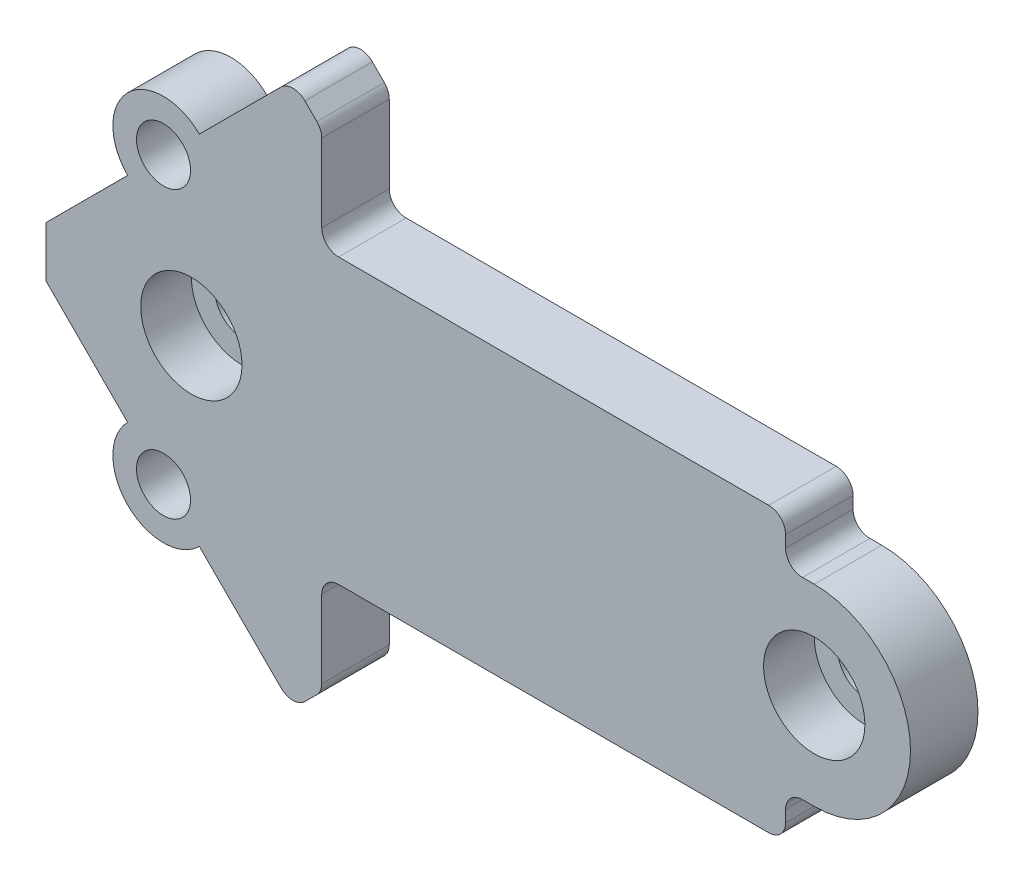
from build123d import *

# Parameters (mm, degrees)
AUFSATZ_LINEAR_AUSTRAGEN1_DEPTH  = 13.8
SCHNITT_LINEAR_AUSTRAGEN4_DEPTH  = 7.4
SKIZZE6_R                        = 3
AUFSATZ_LINEAR_AUSTRAGEN2_DEPTH  = 5.1
SKIZZE7_R                        = 1.25
SCHNITT_LINEAR_AUSTRAGEN5_DEPTH  = 10
SKIZZE8_W                        = 10.8
SKIZZE8_H                        = 9
SCHNITT_LINEAR_AUSTRAGEN6_DEPTH  = 5
SKIZZE9_R                        = 1.6
AUFSATZ_LINEAR_AUSTRAGEN3_DEPTH  = 13.8
AUFSATZ_LINEAR_AUSTRAGEN4_DEPTH  = 13.8
VERRUNDUNG1_R                    = 1
SKIZZE14_W                       = 30
SKIZZE14_H                       = 13
SCHNITT_LINEAR_AUSTRAGEN8_DEPTH  = 7.4
SKIZZE15_W                       = 153.116816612
SKIZZE15_H                       = 90.40738867
SCHNITT_LINEAR_AUSTRAGEN9_DEPTH  = 9.8
SKIZZE16_R                       = 1.6
SCHNITT_LINEAR_AUSTRAGEN10_DEPTH = 9.8
SKIZZE17_R                       = 3
SCHNITT_LINEAR_AUSTRAGEN11_DEPTH = 2
SKIZZE18_R                       = 3
SCHNITT_LINEAR_AUSTRAGEN12_DEPTH = 3


with BuildPart() as part:
    # Skizze1 → Aufsatz-Linear austragen1 (new body)
    with BuildSketch(Plane.XY):
        with BuildLine():
            Line((0, 5.7), (1.7, 5.7))
            Line((1.7, 5.7), (1.7, 8.4))
            Line((1.7, 8.4), (35.2, 8.4))
            Line((35.2, 8.4), (35.2, 5.7))
            Line((35.2, 5.7), (36.9, 5.7))
            ThreePointArc((36.9, 5.7), (42.6, 0), (36.9, -5.7))
            Line((36.9, -5.7), (35.2, -5.7))
            Line((35.2, -5.7), (35.2, -8.4))
            Line((35.2, -8.4), (1.7, -8.4))
            Line((1.7, -8.4), (1.7, -5.7))
            Line((1.7, -5.7), (0, -5.7))
            ThreePointArc((0, -5.7), (-5.7, 0), (0, 5.7))
        make_face()
    extrude(amount=AUFSATZ_LINEAR_AUSTRAGEN1_DEPTH)

    # Skizze5 → Schnitt-Linear austragen4 (cut)
    with BuildSketch(Plane.XY.offset(13.8)):
        with BuildLine():
            Line((0, 3.7), (3.7, 3.7))
            Line((3.7, 3.7), (3.7, 6.4))
            Line((3.7, 6.4), (33.2, 6.4))
            Line((33.2, 6.4), (33.2, 3.7))
            Line((33.2, 3.7), (36.9, 3.7))
            ThreePointArc((36.9, 3.7), (40.6, 0), (36.9, -3.7))
            Line((36.9, -3.7), (33.2, -3.7))
            Line((33.2, -3.7), (33.2, -6.4))
            Line((33.2, -6.4), (3.7, -6.4))
            Line((3.7, -6.4), (3.7, -3.7))
            Line((3.7, -3.7), (0, -3.7))
            ThreePointArc((0, -3.7), (-3.7, 0), (0, 3.7))
        make_face()
    extrude(amount=-SCHNITT_LINEAR_AUSTRAGEN4_DEPTH, mode=Mode.SUBTRACT)

    # Skizze6 → Aufsatz-Linear austragen2 (add)
    with BuildSketch(Plane.XY.offset(6.4)):
        Circle(SKIZZE6_R)
        with Locations((36.9, 0)):
            Circle(SKIZZE6_R)
    extrude(amount=AUFSATZ_LINEAR_AUSTRAGEN2_DEPTH)

    # Skizze7 → Schnitt-Linear austragen5 (cut)
    with BuildSketch(Plane.XY.offset(11.5)):
        Circle(SKIZZE7_R)
        with Locations((36.9, 0)):
            Circle(SKIZZE7_R)
    extrude(amount=-SCHNITT_LINEAR_AUSTRAGEN5_DEPTH, mode=Mode.SUBTRACT)

    # Skizze8 → Schnitt-Linear austragen6 (cut)
    with BuildSketch(Plane(origin=(0, 8.4, 0), x_dir=(1, 0, 0), z_dir=(0, 1, 0))):
        with Locations((18.45, -9.3)):
            Rectangle(SKIZZE8_W, SKIZZE8_H)
    extrude(amount=-SCHNITT_LINEAR_AUSTRAGEN6_DEPTH, mode=Mode.SUBTRACT)

    # Skizze9 → Aufsatz-Linear austragen3 (add)
    with BuildSketch(Plane.XY.offset(13.8)):
        with BuildLine():
            Line((-8.61, 1.5), (-8.61, -1.5))
            Line((-8.61, -1.5), (-3.772082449, -6.334442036))
            ThreePointArc((-3.772082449, -6.334442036), (-3.770557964, -10.577082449), (0.472082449, -10.575557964))
            Line((0.472082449, -10.575557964), (5.310860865, -15.410860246))
            ThreePointArc((5.310860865, -15.410860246), (6.018072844, -15.703499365), (6.725074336, -15.410352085))
            Line((6.725074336, -15.410352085), (7.43192699, -14.702991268))
            ThreePointArc((7.43192699, -14.702991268), (7.72456611, -13.995779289), (7.431418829, -13.288777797))
            Line((7.431418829, -13.288777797), (1.7, -7.561476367))
            Line((1.7, -7.561476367), (1.7, -5.7))
            Line((1.7, -5.7), (-0.3, -5.562913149))
            Line((-0.3, -5.562913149), (-3.743304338, -2.122082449))
            ThreePointArc((-3.743304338, -2.122082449), (-4.622746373, 0), (-3.743304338, 2.122082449))
            Line((-3.743304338, 2.122082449), (-0.3, 5.562913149))
            Line((-0.3, 5.562913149), (1.7, 5.7))
            Line((1.7, 5.7), (1.7, 7.561476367))
            Line((1.7, 7.561476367), (7.431418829, 13.288777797))
            ThreePointArc((7.431418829, 13.288777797), (7.72456611, 13.995779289), (7.43192699, 14.702991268))
            Line((7.43192699, 14.702991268), (6.725074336, 15.410352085))
            ThreePointArc((6.725074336, 15.410352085), (6.018072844, 15.703499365), (5.310860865, 15.410860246))
            Line((5.310860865, 15.410860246), (0.472082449, 10.575557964))
            ThreePointArc((0.472082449, 10.575557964), (-3.770557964, 10.577082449), (-3.772082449, 6.334442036))
            Line((-3.772082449, 6.334442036), (-8.61, 1.5))
        make_face()
        with Locations((-1.65, 8.455)):
            Circle(SKIZZE9_R, mode=Mode.SUBTRACT)
        with Locations((-1.65, -8.455)):
            Circle(SKIZZE9_R, mode=Mode.SUBTRACT)
    extrude(amount=-AUFSATZ_LINEAR_AUSTRAGEN3_DEPTH)

    # Skizze10 → Aufsatz-Linear austragen4 (add)
    with BuildSketch(Plane.XY.offset(13.8)):
        with BuildLine():
            Line((7.724566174, 8.4), (7.724566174, 13.996138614))
            ThreePointArc((7.724566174, 13.996138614), (7.648376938, 13.613289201), (7.431418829, 13.288777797))
            Line((7.431418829, 13.288777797), (2.539126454, 8.4))
            Line((2.539126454, 8.4), (7.724566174, 8.4))
        make_face()
        with BuildLine():
            ThreePointArc((7.431418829, 13.288777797), (7.648376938, 13.613289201), (7.724566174, 13.996138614))
            Line((7.724566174, 13.996138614), (2.539126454, 8.4))
            Line((2.539126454, 8.4), (7.431418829, 13.288777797))
        make_face()
        Polygon((7.724566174, -8.4), (2.539126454, -8.4), (7.724566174, -13.996138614), align=None)
    extrude(amount=-AUFSATZ_LINEAR_AUSTRAGEN4_DEPTH)

    # Verrundung1
    verrundung1_edges = [part.edges().sort_by_distance(p)[0] for p in [
        (7.724566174, 8.4, 6.9),
        (7.724566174, -8.4, 6.9),
        (35.2, 8.4, 6.9),
        (35.2, 5.7, 6.9),
        (35.2, -5.7, 6.9),
        (35.2, -8.4, 6.9),
    ]]
    fillet(verrundung1_edges, radius=VERRUNDUNG1_R)

    # Skizze14 → Schnitt-Linear austragen8 (cut)
    with BuildSketch(Plane.XY.offset(13.8)):
        with Locations((18.45, 0)):
            Rectangle(SKIZZE14_W, SKIZZE14_H)
    extrude(amount=-SCHNITT_LINEAR_AUSTRAGEN8_DEPTH, mode=Mode.SUBTRACT)

    # Skizze15 → Schnitt-Linear austragen9 (cut)
    with BuildSketch(Plane.XY.offset(13.8)):
        with Locations((-23.534827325, 24.119010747)):
            Rectangle(SKIZZE15_W, SKIZZE15_H)
    extrude(amount=-SCHNITT_LINEAR_AUSTRAGEN9_DEPTH, mode=Mode.SUBTRACT)

    # Skizze16 → Schnitt-Linear austragen10 (cut)
    with BuildSketch(Plane.XY.offset(4)):
        Circle(SKIZZE16_R)
        with Locations((36.9, 0)):
            Circle(SKIZZE16_R)
    extrude(amount=-SCHNITT_LINEAR_AUSTRAGEN10_DEPTH, mode=Mode.SUBTRACT)

    # Skizze17 → Schnitt-Linear austragen11 (cut)
    with BuildSketch(Plane.XY.offset(4)):
        Circle(SKIZZE17_R)
        with Locations((36.9, 0)):
            Circle(SKIZZE17_R)
    extrude(amount=-SCHNITT_LINEAR_AUSTRAGEN11_DEPTH, mode=Mode.SUBTRACT)

    # Skizze18 → Schnitt-Linear austragen12 (cut)
    with BuildSketch(Plane.XY.offset(4)):
        Circle(SKIZZE18_R)
        with Locations((36.9, 0)):
            Circle(SKIZZE18_R)
    extrude(amount=-SCHNITT_LINEAR_AUSTRAGEN12_DEPTH, mode=Mode.SUBTRACT)


solid = part.part
